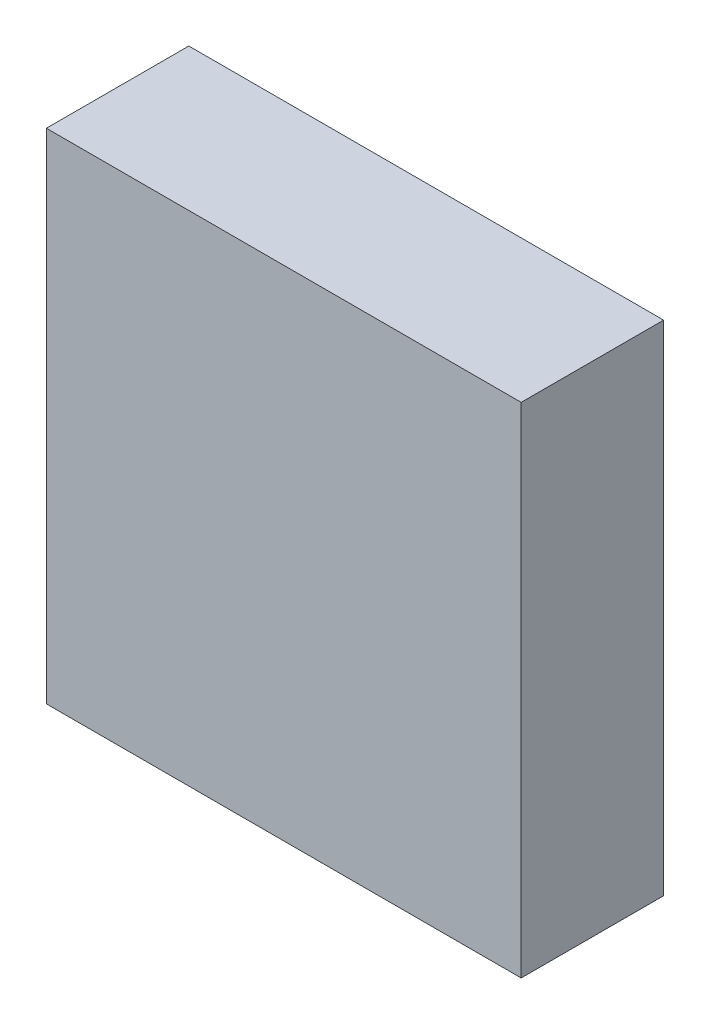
ISO-10303-21;
HEADER;
FILE_DESCRIPTION(('STEP AP214'),'2;1');
FILE_NAME('part.step','',(''),(''),'','','');
FILE_SCHEMA(('AUTOMOTIVE_DESIGN { 1 0 10303 214 1 1 1 1 }'));
ENDSEC;
DATA;
#1=APPLICATION_CONTEXT('core data for automotive mechanical design processes');
#2=APPLICATION_PROTOCOL_DEFINITION('international standard','automotive_design',2000,#1);
#3=PRODUCT_CONTEXT('',#1,'mechanical');
#4=PRODUCT('Part','Part','',(#3));
#5=PRODUCT_RELATED_PRODUCT_CATEGORY('part','',(#4));
#6=PRODUCT_DEFINITION_FORMATION('','',#4);
#7=PRODUCT_DEFINITION_CONTEXT('part definition',#1,'design');
#8=PRODUCT_DEFINITION('design','',#6,#7);
#9=PRODUCT_DEFINITION_SHAPE('','',#8);
#10=(LENGTH_UNIT() NAMED_UNIT(*) SI_UNIT(.MILLI.,.METRE.));
#11=(NAMED_UNIT(*) PLANE_ANGLE_UNIT() SI_UNIT($,.RADIAN.));
#12=(NAMED_UNIT(*) SI_UNIT($,.STERADIAN.) SOLID_ANGLE_UNIT());
#13=UNCERTAINTY_MEASURE_WITH_UNIT(LENGTH_MEASURE(1.E-05),#10,'distance_accuracy_value','');
#14=(GEOMETRIC_REPRESENTATION_CONTEXT(3) GLOBAL_UNCERTAINTY_ASSIGNED_CONTEXT((#13)) GLOBAL_UNIT_ASSIGNED_CONTEXT((#10,
#11,#12)) REPRESENTATION_CONTEXT('',''));
#15=CARTESIAN_POINT('',(0.,0.,0.));
#16=DIRECTION('',(0.,0.,1.));
#17=DIRECTION('',(1.,0.,0.));
#18=AXIS2_PLACEMENT_3D('',#15,#16,#17);
#19=CARTESIAN_POINT('',(1.50000235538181,-1.57499785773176,0.));
#20=DIRECTION('',(1.74845553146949E-07,-0.999999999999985,0.));
#21=DIRECTION('',(-0.999999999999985,-1.74845553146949E-07,0.));
#22=AXIS2_PLACEMENT_3D('',#19,#20,#21);
#23=PLANE('',#22);
#24=DIRECTION('',(0.,0.,1.));
#25=VECTOR('',#24,1.);
#26=CARTESIAN_POINT('',(1.50000235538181,-1.57499785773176,0.));
#27=LINE('',#26,#25);
#28=CARTESIAN_POINT('',(1.50000235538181,-1.57499785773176,0.));
#29=VERTEX_POINT('',#28);
#30=CARTESIAN_POINT('',(1.50000235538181,-1.57499785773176,0.90000074));
#31=VERTEX_POINT('',#30);
#32=EDGE_CURVE('E11',#29,#31,#27,.T.);
#33=ORIENTED_EDGE('',*,*,#32,.T.);
#34=DIRECTION('',(-0.999999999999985,-1.74845553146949E-07,0.));
#35=VECTOR('',#34,1.);
#36=CARTESIAN_POINT('',(1.50000235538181,-1.57499785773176,0.90000074));
#37=LINE('',#36,#35);
#38=CARTESIAN_POINT('',(-1.49999672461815,-1.57499838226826,0.90000074));
#39=VERTEX_POINT('',#38);
#40=EDGE_CURVE('E24',#31,#39,#37,.T.);
#41=ORIENTED_EDGE('',*,*,#40,.T.);
#42=DIRECTION('',(0.,0.,1.));
#43=VECTOR('',#42,1.);
#44=CARTESIAN_POINT('',(-1.49999672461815,-1.57499838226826,0.));
#45=LINE('',#44,#43);
#46=CARTESIAN_POINT('',(-1.49999672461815,-1.57499838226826,0.));
#47=VERTEX_POINT('',#46);
#48=EDGE_CURVE('E84',#47,#39,#45,.T.);
#49=ORIENTED_EDGE('',*,*,#48,.F.);
#50=DIRECTION('',(-0.999999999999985,-1.74845553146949E-07,0.));
#51=VECTOR('',#50,1.);
#52=CARTESIAN_POINT('',(1.50000235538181,-1.57499785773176,0.));
#53=LINE('',#52,#51);
#54=EDGE_CURVE('E82',#29,#47,#53,.T.);
#55=ORIENTED_EDGE('',*,*,#54,.F.);
#56=EDGE_LOOP('',(#33,#41,#49,#55));
#57=FACE_BOUND('',#56,.T.);
#58=ADVANCED_FACE('F17',(#57),#23,.T.);
#59=CARTESIAN_POINT('',(-1.49999672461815,-1.57499838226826,0.));
#60=DIRECTION('',(-0.999999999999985,-1.74845553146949E-07,0.));
#61=DIRECTION('',(-1.74845553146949E-07,0.999999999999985,0.));
#62=AXIS2_PLACEMENT_3D('',#59,#60,#61);
#63=PLANE('',#62);
#64=ORIENTED_EDGE('',*,*,#48,.T.);
#65=DIRECTION('',(-1.74845553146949E-07,0.999999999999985,0.));
#66=VECTOR('',#65,1.);
#67=CARTESIAN_POINT('',(-1.49999672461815,-1.57499838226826,0.90000074));
#68=LINE('',#67,#66);
#69=CARTESIAN_POINT('',(-1.49999727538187,1.57500293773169,0.90000074));
#70=VERTEX_POINT('',#69);
#71=EDGE_CURVE('E79',#39,#70,#68,.T.);
#72=ORIENTED_EDGE('',*,*,#71,.T.);
#73=DIRECTION('',(0.,0.,1.));
#74=VECTOR('',#73,1.);
#75=CARTESIAN_POINT('',(-1.49999727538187,1.57500293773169,0.));
#76=LINE('',#75,#74);
#77=CARTESIAN_POINT('',(-1.49999727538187,1.57500293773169,0.));
#78=VERTEX_POINT('',#77);
#79=EDGE_CURVE('E77',#78,#70,#76,.T.);
#80=ORIENTED_EDGE('',*,*,#79,.F.);
#81=DIRECTION('',(-1.74845553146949E-07,0.999999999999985,0.));
#82=VECTOR('',#81,1.);
#83=CARTESIAN_POINT('',(-1.49999672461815,-1.57499838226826,0.));
#84=LINE('',#83,#82);
#85=EDGE_CURVE('E67',#47,#78,#84,.T.);
#86=ORIENTED_EDGE('',*,*,#85,.F.);
#87=EDGE_LOOP('',(#64,#72,#80,#86));
#88=FACE_BOUND('',#87,.T.);
#89=ADVANCED_FACE('F90',(#88),#63,.T.);
#90=CARTESIAN_POINT('',(-1.49999727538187,1.57500293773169,0.));
#91=DIRECTION('',(-1.74845553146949E-07,0.999999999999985,0.));
#92=DIRECTION('',(0.999999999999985,1.74845553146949E-07,0.));
#93=AXIS2_PLACEMENT_3D('',#90,#91,#92);
#94=PLANE('',#93);
#95=ORIENTED_EDGE('',*,*,#79,.T.);
#96=DIRECTION('',(0.999999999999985,1.74845553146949E-07,0.));
#97=VECTOR('',#96,1.);
#98=CARTESIAN_POINT('',(-1.49999727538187,1.57500293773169,0.90000074));
#99=LINE('',#98,#97);
#100=CARTESIAN_POINT('',(1.50000180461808,1.57500346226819,0.90000074));
#101=VERTEX_POINT('',#100);
#102=EDGE_CURVE('E59',#70,#101,#99,.T.);
#103=ORIENTED_EDGE('',*,*,#102,.T.);
#104=DIRECTION('',(0.,0.,1.));
#105=VECTOR('',#104,1.);
#106=CARTESIAN_POINT('',(1.50000180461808,1.57500346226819,0.));
#107=LINE('',#106,#105);
#108=CARTESIAN_POINT('',(1.50000180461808,1.57500346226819,0.));
#109=VERTEX_POINT('',#108);
#110=EDGE_CURVE('E54',#109,#101,#107,.T.);
#111=ORIENTED_EDGE('',*,*,#110,.F.);
#112=DIRECTION('',(0.999999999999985,1.74845553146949E-07,0.));
#113=VECTOR('',#112,1.);
#114=CARTESIAN_POINT('',(-1.49999727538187,1.57500293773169,0.));
#115=LINE('',#114,#113);
#116=EDGE_CURVE('E58',#78,#109,#115,.T.);
#117=ORIENTED_EDGE('',*,*,#116,.F.);
#118=EDGE_LOOP('',(#95,#103,#111,#117));
#119=FACE_BOUND('',#118,.T.);
#120=ADVANCED_FACE('F57',(#119),#94,.T.);
#121=CARTESIAN_POINT('',(1.50000180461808,1.57500346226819,0.));
#122=DIRECTION('',(0.999999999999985,1.74845553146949E-07,0.));
#123=DIRECTION('',(1.74845553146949E-07,-0.999999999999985,0.));
#124=AXIS2_PLACEMENT_3D('',#121,#122,#123);
#125=PLANE('',#124);
#126=ORIENTED_EDGE('',*,*,#110,.T.);
#127=DIRECTION('',(1.74845553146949E-07,-0.999999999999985,0.));
#128=VECTOR('',#127,1.);
#129=CARTESIAN_POINT('',(1.50000180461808,1.57500346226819,0.90000074));
#130=LINE('',#129,#128);
#131=EDGE_CURVE('E69',#101,#31,#130,.T.);
#132=ORIENTED_EDGE('',*,*,#131,.T.);
#133=ORIENTED_EDGE('',*,*,#32,.F.);
#134=DIRECTION('',(1.74845553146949E-07,-0.999999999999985,0.));
#135=VECTOR('',#134,1.);
#136=CARTESIAN_POINT('',(1.50000180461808,1.57500346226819,0.));
#137=LINE('',#136,#135);
#138=EDGE_CURVE('E66',#109,#29,#137,.T.);
#139=ORIENTED_EDGE('',*,*,#138,.F.);
#140=EDGE_LOOP('',(#126,#132,#133,#139));
#141=FACE_BOUND('',#140,.T.);
#142=ADVANCED_FACE('F71',(#141),#125,.T.);
#143=CARTESIAN_POINT('',(1.50000235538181,-1.57499785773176,0.));
#144=DIRECTION('',(0.,0.,1.));
#145=DIRECTION('',(0.999999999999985,1.74845553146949E-07,0.));
#146=AXIS2_PLACEMENT_3D('',#143,#144,#145);
#147=PLANE('',#146);
#148=ORIENTED_EDGE('',*,*,#54,.T.);
#149=ORIENTED_EDGE('',*,*,#85,.T.);
#150=ORIENTED_EDGE('',*,*,#116,.T.);
#151=ORIENTED_EDGE('',*,*,#138,.T.);
#152=EDGE_LOOP('',(#148,#149,#150,#151));
#153=FACE_BOUND('',#152,.T.);
#154=ADVANCED_FACE('F65',(#153),#147,.F.);
#155=CARTESIAN_POINT('',(1.50000235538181,-1.57499785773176,0.90000074));
#156=DIRECTION('',(0.,0.,1.));
#157=DIRECTION('',(0.999999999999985,1.74845553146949E-07,0.));
#158=AXIS2_PLACEMENT_3D('',#155,#156,#157);
#159=PLANE('',#158);
#160=ORIENTED_EDGE('',*,*,#131,.F.);
#161=ORIENTED_EDGE('',*,*,#102,.F.);
#162=ORIENTED_EDGE('',*,*,#71,.F.);
#163=ORIENTED_EDGE('',*,*,#40,.F.);
#164=EDGE_LOOP('',(#160,#161,#162,#163));
#165=FACE_BOUND('',#164,.T.);
#166=ADVANCED_FACE('F91',(#165),#159,.T.);
#167=CLOSED_SHELL('',(#58,#89,#120,#142,#154,#166));
#168=MANIFOLD_SOLID_BREP('B1',#167);
#169=ADVANCED_BREP_SHAPE_REPRESENTATION('',(#18,#168),#14);
#170=SHAPE_DEFINITION_REPRESENTATION(#9,#169);
ENDSEC;
END-ISO-10303-21;
